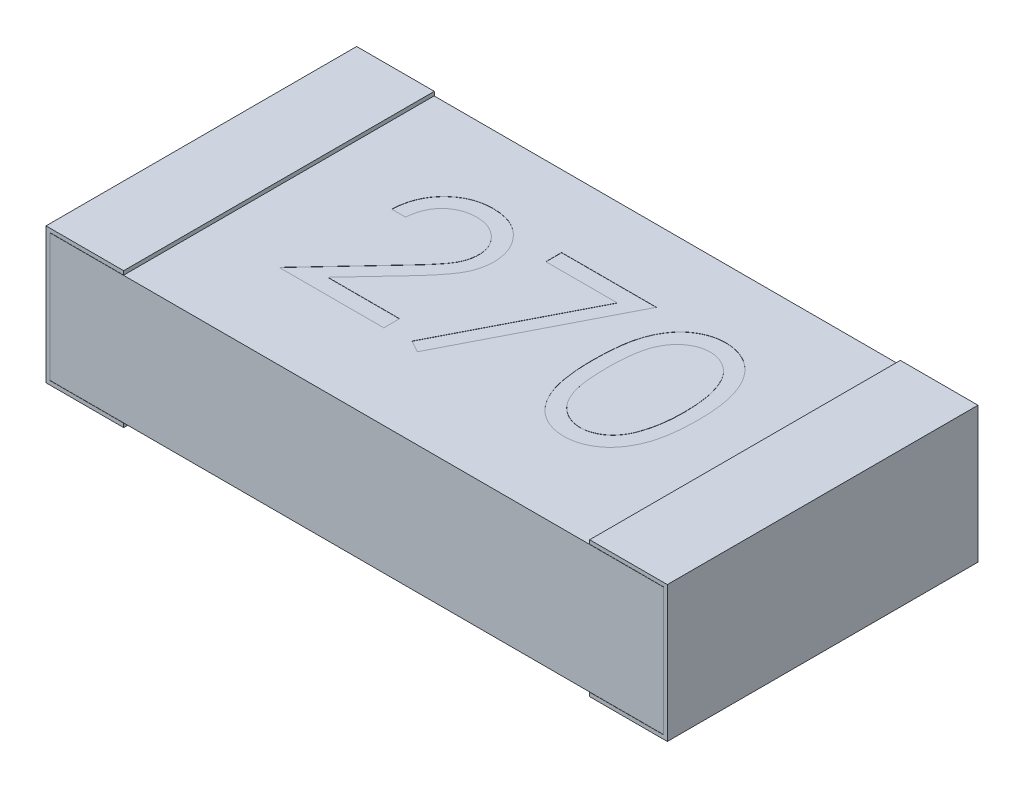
from build123d import *

# Parameters (mm, degrees)
SKETCH1_W           = 3.2
SKETCH1_H           = 1.6
BOSS_EXTRUDE1_DEPTH = 0.7
SKETCH2_W           = 2.4
SKETCH2_H           = 0.021
CUT_EXTRUDE1_DEPTH  = 4.645545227
CUT_EXTRUDE2_DEPTH  = 4.645545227
CUT_EXTRUDE3_DEPTH  = 0.001


with BuildPart() as part:
    # Sketch1 → Boss-Extrude1 (new body)
    with BuildSketch(Plane(origin=(0, 0, 0), x_dir=(1, 0, 0), z_dir=(0, 1, 0))):
        with Locations((1.6, 0.8)):
            Rectangle(SKETCH1_W, SKETCH1_H)
    extrude(amount=BOSS_EXTRUDE1_DEPTH)

    # Sketch2 → Cut-Extrude1 (cut, through all)
    with BuildSketch(Plane.XY):
        with Locations((1.6, 0.6895)):
            Rectangle(SKETCH2_W, SKETCH2_H)
        with Locations((1.6, 0.0105)):
            Rectangle(SKETCH2_W, SKETCH2_H)
    extrude(amount=-CUT_EXTRUDE1_DEPTH, mode=Mode.SUBTRACT)

    # Sketch5 → Cut-Extrude2 (cut, through all)
    with BuildSketch(Plane.XY):
        Polygon((0.02, 0.02), (0.4, 0.02), (0.4, 0.021), (0.021, 0.021), (0.021, 0.679), (0.4, 0.679), (0.4, 0.68), (0.02, 0.68), align=None)
        Polygon((3.179, 0.021), (2.8, 0.021), (2.8, 0.02), (3.18, 0.02), (3.18, 0.68), (2.8, 0.68), (2.8, 0.679), (3.179, 0.679), align=None)
    extrude(amount=-CUT_EXTRUDE2_DEPTH, mode=Mode.SUBTRACT)


with BuildPart() as cut_extrude2_piece_1:
    # of the separate pieces the step leaves, piece 1, a body of its own (cut_extrude2_pieces)
    add(part.part.solids().sort_by_distance((3.179, 0.679, 0))[0])

    # Sketch6 → Cut-Extrude3 (cut)
    # profile 1 of 3: a face of its own
    with BuildSketch(Plane(origin=(0, 0.679, 0), x_dir=(1, 0, 0), z_dir=(0, 1, 0))):
        with BuildLine():
            Line((0.866030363, 0.985569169), (0.794796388, 0.985569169))
            add(Edge.make_bspline(
                [(0.794796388, 0.985569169), (0.795260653, 0.995019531), (0.796172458, 1.013579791), (0.800442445, 1.040640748), (0.806552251, 1.066506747), (0.815190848, 1.090970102), (0.825919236, 1.114247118), (0.838784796, 1.136245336), (0.854023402, 1.156880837), (0.871306, 1.175962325), (0.890076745, 1.193467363), (0.910330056, 1.20858382), (0.931612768, 1.221355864), (0.95386031, 1.232033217), (0.977323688, 1.240047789), (1.001789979, 1.245994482), (1.027366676, 1.249572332), (1.044792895, 1.249956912), (1.053655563, 1.250152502)],
                knots=[0, 0, 0, 0, 1.10065271, 2.161652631, 3.183658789, 4.190468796, 5.17591951, 6.163126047, 7.15150782, 8.156236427, 9.156009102, 10.134482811, 11.092018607, 12.041330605, 13.001268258, 13.972401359, 14.968799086, 16, 16, 16, 16], degree=3))
            add(Edge.make_bspline(
                [(1.053655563, 1.250152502), (1.062359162, 1.249948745), (1.079461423, 1.24954837), (1.104421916, 1.246110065), (1.128183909, 1.240724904), (1.150700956, 1.233169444), (1.171793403, 1.223012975), (1.191619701, 1.210812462), (1.210415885, 1.196701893), (1.227335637, 1.180088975), (1.242872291, 1.162353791), (1.256275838, 1.143419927), (1.26775418, 1.123864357), (1.277321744, 1.103537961), (1.284364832, 1.082249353), (1.289712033, 1.06030847), (1.2927345, 1.0374882), (1.293198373, 1.022042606), (1.293434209, 1.014189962)],
                knots=[0, 0, 0, 0, 1.111607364, 2.184268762, 3.212621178, 4.221274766, 5.211760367, 6.196651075, 7.1921475, 8.207485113, 9.220403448, 10.201281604, 11.166441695, 12.114753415, 13.065576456, 14.026450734, 14.996634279, 16, 16, 16, 16], degree=3))
            add(Edge.make_bspline(
                [(1.293434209, 1.014189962), (1.293050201, 1.00313465), (1.292288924, 0.98121803), (1.285776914, 0.949011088), (1.275606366, 0.917806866), (1.263360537, 0.892693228), (1.251006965, 0.872456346), (1.239874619, 0.855794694), (1.226842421, 0.837854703), (1.21172069, 0.81869645), (1.194822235, 0.79816987), (1.175993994, 0.776287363), (1.155101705, 0.753275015), (1.140438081, 0.737557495), (1.132839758, 0.729413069)],
                knots=[0, 0, 0, 0, 1.184426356, 2.348067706, 3.509069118, 4.696110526, 5.333549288, 6.050745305, 6.844228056, 7.710549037, 8.667450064, 9.695053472, 10.805634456, 12, 12, 12, 12], degree=3))
            Line((1.132839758, 0.729413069), (0.934243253, 0.517460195))
            Line((0.934243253, 0.517460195), (1.303610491, 0.517460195))
            Line((1.303610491, 0.517460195), (1.303610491, 0.436049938))
            Line((1.303610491, 0.436049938), (0.764267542, 0.436049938))
            Line((0.764267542, 0.436049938), (1.072100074, 0.764553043))
            add(Edge.make_bspline(
                [(1.072100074, 0.764553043), (1.079594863, 0.772376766), (1.093990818, 0.787404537), (1.114352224, 0.809344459), (1.132639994, 0.829698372), (1.14897251, 0.848427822), (1.162995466, 0.865806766), (1.175439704, 0.881272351), (1.185410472, 0.895504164), (1.196231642, 0.912000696), (1.206712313, 0.932142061), (1.215718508, 0.956755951), (1.22121009, 0.982094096), (1.221868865, 0.999216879), (1.222200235, 1.007829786)],
                knots=[0, 0, 0, 0, 1.329631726, 2.553950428, 3.673215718, 4.687767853, 5.603093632, 6.413772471, 7.123043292, 7.734684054, 8.834405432, 9.900288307, 10.943827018, 12, 12, 12, 12], degree=3))
            add(Edge.make_bspline(
                [(1.222200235, 1.007829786), (1.222056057, 1.013245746), (1.221771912, 1.023919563), (1.219264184, 1.039569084), (1.21547448, 1.054665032), (1.210044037, 1.069253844), (1.20287608, 1.08318884), (1.194150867, 1.096486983), (1.184083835, 1.109343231), (1.172438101, 1.121397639), (1.159644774, 1.132437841), (1.146129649, 1.142217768), (1.131830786, 1.150390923), (1.116808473, 1.157090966), (1.10110459, 1.162346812), (1.084688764, 1.165988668), (1.067606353, 1.168275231), (1.055941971, 1.168584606), (1.049998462, 1.168742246)],
                knots=[0, 0, 0, 0, 0.991446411, 1.95395049, 2.89581595, 3.838931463, 4.798493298, 5.75982156, 6.748411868, 7.785213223, 8.824556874, 9.840280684, 10.836137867, 11.835679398, 12.848801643, 13.863922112, 14.911575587, 16, 16, 16, 16], degree=3))
            add(Edge.make_bspline(
                [(1.049998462, 1.168742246), (1.043791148, 1.168580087), (1.031601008, 1.168261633), (1.013703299, 1.166033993), (0.99662956, 1.162190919), (0.980336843, 1.15693478), (0.96479758, 1.150254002), (0.950087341, 1.141932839), (0.93623915, 1.132003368), (0.923226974, 1.120745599), (0.911238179, 1.108211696), (0.900704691, 1.094239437), (0.891500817, 1.079083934), (0.883470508, 1.06278608), (0.876949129, 1.045197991), (0.871965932, 1.026382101), (0.868022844, 1.006420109), (0.866705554, 0.99263492), (0.866030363, 0.985569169)],
                knots=[0, 0, 0, 0, 1.031018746, 2.02475058, 2.990194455, 3.934040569, 4.864654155, 5.795059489, 6.735614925, 7.690564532, 8.649604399, 9.611025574, 10.590972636, 11.591080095, 12.624614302, 13.701020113, 14.821632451, 16, 16, 16, 16], degree=3))
        make_face()
    # profile 2 of 3: a face of its own
    with BuildSketch(Plane(origin=(0, 0.679, 0), x_dir=(1, 0, 0), z_dir=(0, 1, 0))):
        Polygon((1.425725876, 1.229799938), (1.914187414, 1.229799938), (1.49695985, 0.415697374), (1.435425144, 0.449565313), (1.793662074, 1.148389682), (1.425725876, 1.148389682), align=None)
    # profile 3 of 3: a face of its own
    with BuildSketch(Plane(origin=(0, 0.679, 0), x_dir=(1, 0, 0), z_dir=(0, 1, 0))):
        with BuildLine():
            add(Edge.make_bspline(
                [(1.985421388, 0.832606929), (1.985495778, 0.845329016), (1.985640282, 0.870041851), (1.987247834, 0.90605194), (1.989918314, 0.939834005), (1.993578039, 0.971389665), (1.998031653, 1.000727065), (2.00397695, 1.027767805), (2.010738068, 1.052637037), (2.018574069, 1.075415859), (2.027415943, 1.096411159), (2.037039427, 1.11601116), (2.047826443, 1.134186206), (2.059160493, 1.151226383), (2.071500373, 1.166852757), (2.08449492, 1.181286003), (2.09865131, 1.194192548), (2.113488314, 1.205950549), (2.129140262, 1.21625784), (2.14516101, 1.225336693), (2.161660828, 1.233092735), (2.178684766, 1.239191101), (2.19607981, 1.244228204), (2.21390677, 1.24767284), (2.23219508, 1.249840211), (2.244539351, 1.250047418), (2.250799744, 1.250152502)],
                knots=[0, 0, 0, 0, 1.646270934, 3.197905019, 4.663502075, 6.030701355, 7.308322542, 8.50163776, 9.611534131, 10.641858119, 11.616356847, 12.558055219, 13.465016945, 14.349605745, 15.204443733, 16.039544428, 16.859896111, 17.680448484, 18.487036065, 19.28249412, 20.06191084, 20.843045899, 21.620316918, 22.403196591, 23.190181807, 24, 24, 24, 24], degree=3))
            add(Edge.make_bspline(
                [(2.250799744, 1.250152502), (2.257112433, 1.250041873), (2.269666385, 1.249821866), (2.288226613, 1.247707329), (2.306358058, 1.244198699), (2.323983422, 1.239227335), (2.341247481, 1.233059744), (2.358015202, 1.225329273), (2.374390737, 1.216330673), (2.390113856, 1.205757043), (2.40535717, 1.193968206), (2.419746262, 1.180641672), (2.43328244, 1.165912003), (2.44613559, 1.149936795), (2.457941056, 1.132409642), (2.469183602, 1.113635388), (2.479246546, 1.09328571), (2.48893816, 1.07170014), (2.497303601, 1.048281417), (2.50484791, 1.023161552), (2.510943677, 0.996043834), (2.516021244, 0.967070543), (2.519954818, 0.936135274), (2.522819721, 0.903304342), (2.524333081, 0.868556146), (2.524618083, 0.844798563), (2.524764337, 0.832606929)],
                knots=[0, 0, 0, 0, 0.810914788, 1.612654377, 2.396697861, 3.181598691, 3.963628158, 4.749916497, 5.551656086, 6.361998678, 7.18212741, 8.025565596, 8.878627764, 9.750805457, 10.657531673, 11.591944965, 12.560506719, 13.57287815, 14.630710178, 15.753379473, 16.941251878, 18.199788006, 19.531962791, 20.947069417, 22.433333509, 24, 24, 24, 24], degree=3))
            add(Edge.make_bspline(
                [(2.524764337, 0.832606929), (2.524616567, 0.820468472), (2.524328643, 0.796817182), (2.522836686, 0.762225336), (2.519897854, 0.729568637), (2.51622166, 0.698768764), (2.511130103, 0.669953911), (2.504869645, 0.643024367), (2.49791859, 0.617863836), (2.489338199, 0.594678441), (2.479946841, 0.573144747), (2.469728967, 0.553036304), (2.45878206, 0.534175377), (2.446855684, 0.516712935), (2.43414357, 0.500525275), (2.420373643, 0.485898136), (2.405934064, 0.472479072), (2.390645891, 0.460538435), (2.374677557, 0.45008706), (2.358358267, 0.440740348), (2.341398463, 0.433203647), (2.32418249, 0.426732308), (2.306464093, 0.421788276), (2.288265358, 0.418369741), (2.269678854, 0.415972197), (2.257114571, 0.415789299), (2.250799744, 0.415697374)],
                knots=[0, 0, 0, 0, 1.561518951, 3.042555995, 4.452378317, 5.7783523, 7.031515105, 8.214008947, 9.334062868, 10.386615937, 11.391082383, 12.354592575, 13.286541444, 14.194233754, 15.072674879, 15.931287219, 16.775624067, 17.606195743, 18.42308326, 19.229000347, 20.022332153, 20.807536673, 21.593273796, 22.3848459, 23.188221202, 24, 24, 24, 24], degree=3))
            add(Edge.make_bspline(
                [(2.250799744, 0.415697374), (2.244539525, 0.415803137), (2.232195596, 0.41601168), (2.213904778, 0.418169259), (2.196151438, 0.42163806), (2.178847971, 0.42649504), (2.1619056, 0.432440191), (2.145555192, 0.440185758), (2.12961495, 0.449106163), (2.1141274, 0.459265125), (2.099383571, 0.470904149), (2.085300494, 0.483777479), (2.072231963, 0.49820636), (2.060068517, 0.51396296), (2.048508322, 0.530902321), (2.037874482, 0.54925572), (2.028038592, 0.568950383), (2.019048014, 0.590113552), (2.011076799, 0.613054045), (2.004035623, 0.638034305), (1.998476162, 0.665274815), (1.993717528, 0.694556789), (1.989879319, 0.726006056), (1.987258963, 0.759639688), (1.985639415, 0.795436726), (1.98549539, 0.819990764), (1.985421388, 0.832606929)],
                knots=[0, 0, 0, 0, 0.810891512, 1.598919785, 2.382837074, 3.152667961, 3.926044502, 4.706494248, 5.493654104, 6.291793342, 7.103789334, 7.925228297, 8.761435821, 9.622817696, 10.50288917, 11.416980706, 12.369136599, 13.353924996, 14.394355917, 15.514179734, 16.714354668, 17.994756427, 19.357759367, 20.818452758, 22.365282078, 24, 24, 24, 24], degree=3))
        make_face()
        with BuildLine():
            add(Edge.make_bspline(
                [(2.056655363, 0.832924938), (2.056682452, 0.822323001), (2.056735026, 0.801746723), (2.058108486, 0.771846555), (2.05997952, 0.743958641), (2.062392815, 0.718047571), (2.065976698, 0.694201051), (2.069992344, 0.672255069), (2.074879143, 0.652325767), (2.080661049, 0.634276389), (2.087246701, 0.617800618), (2.094437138, 0.602469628), (2.102161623, 0.588102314), (2.110806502, 0.574827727), (2.120221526, 0.562602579), (2.130194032, 0.551210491), (2.141096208, 0.541051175), (2.156178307, 0.528866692), (2.176089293, 0.516275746), (2.201176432, 0.505311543), (2.226954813, 0.498421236), (2.244451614, 0.497544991), (2.25318481, 0.497107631)],
                knots=[0, 0, 0, 0, 1.459021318, 2.831673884, 4.118529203, 5.306027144, 6.411944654, 7.436330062, 8.375795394, 9.233974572, 10.042671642, 10.816086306, 11.563610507, 12.285937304, 12.993564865, 13.685989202, 14.367179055, 15.041617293, 16.353048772, 17.594441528, 18.799311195, 20, 20, 20, 20], degree=3))
            add(Edge.make_bspline(
                [(2.25318481, 0.497107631), (2.261974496, 0.497469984), (2.279535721, 0.498193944), (2.30519285, 0.505178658), (2.330100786, 0.515717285), (2.349620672, 0.528178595), (2.364471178, 0.540045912), (2.375111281, 0.550163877), (2.384877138, 0.561493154), (2.394139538, 0.573716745), (2.402634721, 0.587068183), (2.410359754, 0.601483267), (2.417409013, 0.617002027), (2.421425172, 0.627835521), (2.42347853, 0.633374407)],
                knots=[0, 0, 0, 0, 1.353760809, 2.704726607, 4.075137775, 5.516104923, 6.260822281, 7.007110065, 7.778089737, 8.566572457, 9.372053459, 10.217411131, 11.088608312, 12, 12, 12, 12], degree=3))
            add(Edge.make_bspline(
                [(2.42347853, 0.633374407), (2.42587152, 0.640456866), (2.430730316, 0.654837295), (2.436992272, 0.677144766), (2.441923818, 0.700549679), (2.44636051, 0.72491216), (2.449388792, 0.750411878), (2.451826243, 0.776969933), (2.453261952, 0.804606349), (2.453439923, 0.82338307), (2.453530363, 0.832924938)],
                knots=[0, 0, 0, 0, 0.884706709, 1.796334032, 2.740027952, 3.714592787, 4.726048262, 5.777819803, 6.87074269, 8, 8, 8, 8], degree=3))
            add(Edge.make_bspline(
                [(2.453530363, 0.832924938), (2.453405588, 0.842465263), (2.453161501, 0.861128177), (2.452228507, 0.888459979), (2.449819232, 0.914419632), (2.447143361, 0.939118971), (2.44319792, 0.962421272), (2.438943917, 0.984521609), (2.433228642, 1.005146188), (2.427123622, 1.024617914), (2.420136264, 1.042715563), (2.41244466, 1.059523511), (2.404230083, 1.075122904), (2.395307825, 1.089470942), (2.385783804, 1.102631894), (2.375406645, 1.114341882), (2.364587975, 1.124963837), (2.349434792, 1.137088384), (2.329596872, 1.149450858), (2.304912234, 1.160827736), (2.27922407, 1.167361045), (2.261858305, 1.168282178), (2.25318481, 1.168742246)],
                knots=[0, 0, 0, 0, 1.31362396, 2.569729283, 3.763502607, 4.902122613, 5.988968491, 7.01645872, 7.998833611, 8.933434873, 9.825090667, 10.667526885, 11.477055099, 12.250526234, 12.991942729, 13.710640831, 14.402115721, 15.076753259, 16.378508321, 17.609869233, 18.806226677, 20, 20, 20, 20], degree=3))
            add(Edge.make_bspline(
                [(2.25318481, 1.168742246), (2.244405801, 1.168281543), (2.226831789, 1.167359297), (2.200876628, 1.160852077), (2.175997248, 1.149509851), (2.156211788, 1.137047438), (2.141048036, 1.125177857), (2.130370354, 1.114884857), (2.120358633, 1.103625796), (2.111135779, 1.091288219), (2.102497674, 1.078029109), (2.09456448, 1.063744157), (2.0874168, 1.048360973), (2.080820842, 1.031892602), (2.075021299, 1.013844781), (2.07023749, 0.993940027), (2.065818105, 0.972063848), (2.062689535, 0.948088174), (2.05990829, 0.922170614), (2.058120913, 0.89421308), (2.056730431, 0.864262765), (2.056680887, 0.843580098), (2.056655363, 0.832924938)],
                knots=[0, 0, 0, 0, 1.207732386, 2.417664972, 3.655092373, 4.956220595, 5.625982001, 6.301752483, 6.994047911, 7.697131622, 8.419323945, 9.170223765, 9.943494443, 10.752040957, 11.610060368, 12.549350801, 13.567764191, 14.679664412, 15.874934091, 17.154273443, 18.533957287, 20, 20, 20, 20], degree=3))
        make_face(mode=Mode.SUBTRACT)
    extrude(amount=-CUT_EXTRUDE3_DEPTH, mode=Mode.SUBTRACT)


with BuildPart() as cut_extrude2_piece_2:
    # of the separate pieces the step leaves, piece 2, a body of its own (cut_extrude2_pieces)
    add(part.part.solids().sort_by_distance((2.8, 0, 0))[0])


with BuildPart() as cut_extrude2_piece_3:
    # of the separate pieces the step leaves, piece 3, a body of its own (cut_extrude2_pieces)
    add(part.part.solids().sort_by_distance((0, 0, 0))[0])


solid = Compound([cut_extrude2_piece_1.part, cut_extrude2_piece_2.part, cut_extrude2_piece_3.part])
